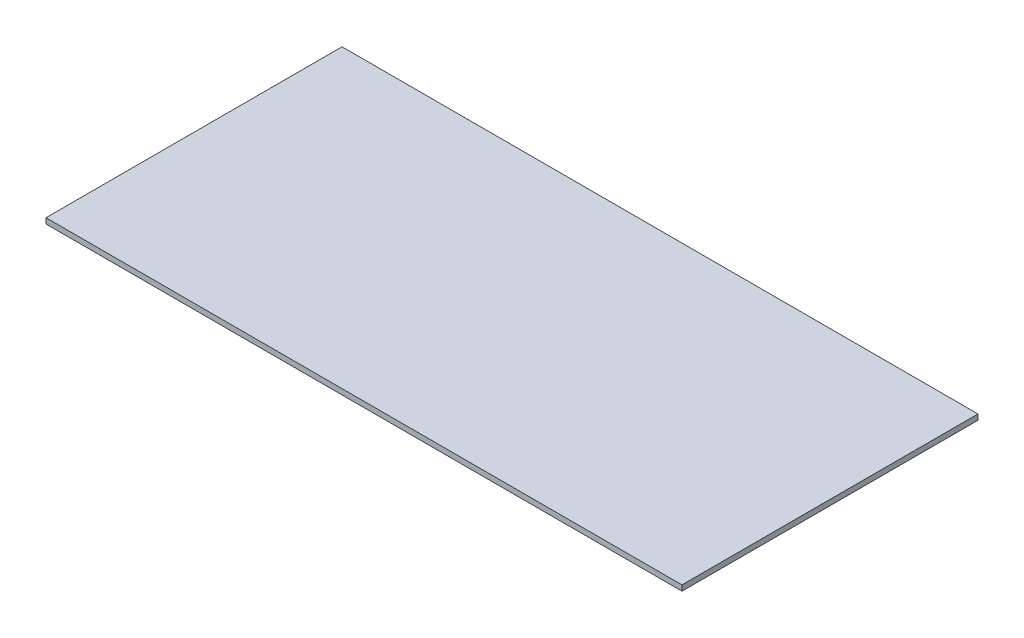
from build123d import *

# Parameters (mm, degrees)
SKIZZE1_W                       = 580
SKIZZE1_H                       = 270
AUFSATZ_LINEAR_AUSTRAGEN1_DEPTH = 5


with BuildPart() as part:
    # Skizze1 → Aufsatz-Linear austragen1 (new body)
    with BuildSketch(Plane(origin=(0, 0, 0), x_dir=(1, 0, 0), z_dir=(0, 1, 0))):
        Rectangle(SKIZZE1_W, SKIZZE1_H)
    extrude(amount=AUFSATZ_LINEAR_AUSTRAGEN1_DEPTH)


solid = part.part
